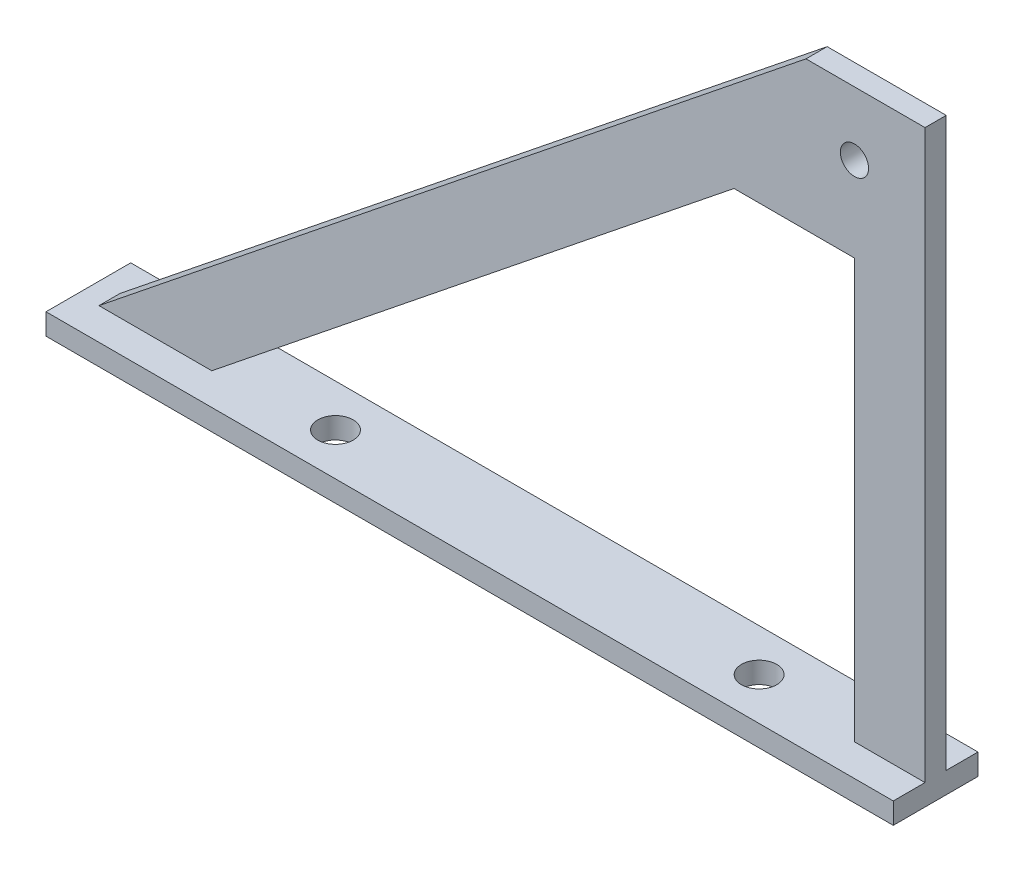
ISO-10303-21;
HEADER;
FILE_DESCRIPTION(('STEP AP214'),'2;1');
FILE_NAME('part.step','',(''),(''),'','','');
FILE_SCHEMA(('AUTOMOTIVE_DESIGN { 1 0 10303 214 1 1 1 1 }'));
ENDSEC;
DATA;
#1=APPLICATION_CONTEXT('core data for automotive mechanical design processes');
#2=APPLICATION_PROTOCOL_DEFINITION('international standard','automotive_design',2000,#1);
#3=PRODUCT_CONTEXT('',#1,'mechanical');
#4=PRODUCT('Part','Part','',(#3));
#5=PRODUCT_RELATED_PRODUCT_CATEGORY('part','',(#4));
#6=PRODUCT_DEFINITION_FORMATION('','',#4);
#7=PRODUCT_DEFINITION_CONTEXT('part definition',#1,'design');
#8=PRODUCT_DEFINITION('design','',#6,#7);
#9=PRODUCT_DEFINITION_SHAPE('','',#8);
#10=(LENGTH_UNIT() NAMED_UNIT(*) SI_UNIT(.MILLI.,.METRE.));
#11=(NAMED_UNIT(*) PLANE_ANGLE_UNIT() SI_UNIT($,.RADIAN.));
#12=(NAMED_UNIT(*) SI_UNIT($,.STERADIAN.) SOLID_ANGLE_UNIT());
#13=UNCERTAINTY_MEASURE_WITH_UNIT(LENGTH_MEASURE(1.E-05),#10,'distance_accuracy_value','');
#14=(GEOMETRIC_REPRESENTATION_CONTEXT(3) GLOBAL_UNCERTAINTY_ASSIGNED_CONTEXT((#13)) GLOBAL_UNIT_ASSIGNED_CONTEXT((#10,
#11,#12)) REPRESENTATION_CONTEXT('',''));
#15=CARTESIAN_POINT('',(0.,0.,0.));
#16=DIRECTION('',(0.,0.,1.));
#17=DIRECTION('',(1.,0.,0.));
#18=AXIS2_PLACEMENT_3D('',#15,#16,#17);
#19=CARTESIAN_POINT('',(60.,3.,50.));
#20=DIRECTION('',(-1.,0.,0.));
#21=DIRECTION('',(0.,0.,1.));
#22=AXIS2_PLACEMENT_3D('',#19,#20,#21);
#23=PLANE('',#22);
#24=DIRECTION('',(0.,1.,0.));
#25=VECTOR('',#24,1.);
#26=CARTESIAN_POINT('',(60.,96.8669270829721,54.5));
#27=LINE('',#26,#25);
#28=CARTESIAN_POINT('',(60.,3.,54.5));
#29=VERTEX_POINT('',#28);
#30=CARTESIAN_POINT('',(60.,83.3390295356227,54.5));
#31=VERTEX_POINT('',#30);
#32=EDGE_CURVE('E182',#29,#31,#27,.T.);
#33=ORIENTED_EDGE('',*,*,#32,.T.);
#34=DIRECTION('',(0.,0.,1.));
#35=VECTOR('',#34,1.);
#36=CARTESIAN_POINT('',(60.,83.3390295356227,-62.5));
#37=LINE('',#36,#35);
#38=CARTESIAN_POINT('',(60.,83.3390295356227,57.5));
#39=VERTEX_POINT('',#38);
#40=EDGE_CURVE('E62',#31,#39,#37,.T.);
#41=ORIENTED_EDGE('',*,*,#40,.T.);
#42=DIRECTION('',(0.,1.,0.));
#43=VECTOR('',#42,1.);
#44=CARTESIAN_POINT('',(60.,96.8669270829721,57.5));
#45=LINE('',#44,#43);
#46=CARTESIAN_POINT('',(60.,3.,57.5));
#47=VERTEX_POINT('',#46);
#48=EDGE_CURVE('E149',#47,#39,#45,.T.);
#49=ORIENTED_EDGE('',*,*,#48,.F.);
#50=DIRECTION('',(0.,0.,-1.));
#51=VECTOR('',#50,1.);
#52=CARTESIAN_POINT('',(60.,3.,50.));
#53=LINE('',#52,#51);
#54=CARTESIAN_POINT('',(60.,3.,62.));
#55=VERTEX_POINT('',#54);
#56=EDGE_CURVE('E197',#55,#47,#53,.T.);
#57=ORIENTED_EDGE('',*,*,#56,.F.);
#58=DIRECTION('',(0.,-1.,0.));
#59=VECTOR('',#58,1.);
#60=CARTESIAN_POINT('',(60.,3.,62.));
#61=LINE('',#60,#59);
#62=CARTESIAN_POINT('',(60.,0.,62.));
#63=VERTEX_POINT('',#62);
#64=EDGE_CURVE('E211',#55,#63,#61,.T.);
#65=ORIENTED_EDGE('',*,*,#64,.T.);
#66=DIRECTION('',(0.,0.,-1.));
#67=VECTOR('',#66,1.);
#68=CARTESIAN_POINT('',(60.,0.,50.));
#69=LINE('',#68,#67);
#70=CARTESIAN_POINT('',(60.,0.,50.));
#71=VERTEX_POINT('',#70);
#72=EDGE_CURVE('E196',#63,#71,#69,.T.);
#73=ORIENTED_EDGE('',*,*,#72,.T.);
#74=DIRECTION('',(0.,-1.,0.));
#75=VECTOR('',#74,1.);
#76=CARTESIAN_POINT('',(60.,3.,50.));
#77=LINE('',#76,#75);
#78=CARTESIAN_POINT('',(60.,3.,50.));
#79=VERTEX_POINT('',#78);
#80=EDGE_CURVE('E55',#79,#71,#77,.T.);
#81=ORIENTED_EDGE('',*,*,#80,.F.);
#82=EDGE_CURVE('E202',#29,#79,#53,.T.);
#83=ORIENTED_EDGE('',*,*,#82,.F.);
#84=EDGE_LOOP('',(#33,#41,#49,#57,#65,#73,#81,#83));
#85=FACE_BOUND('',#84,.T.);
#86=ADVANCED_FACE('F47',(#85),#23,.F.);
#87=CARTESIAN_POINT('',(-60.,3.,50.));
#88=DIRECTION('',(0.,0.,1.));
#89=DIRECTION('',(1.,0.,0.));
#90=AXIS2_PLACEMENT_3D('',#87,#88,#89);
#91=PLANE('',#90);
#92=DIRECTION('',(-1.,0.,0.));
#93=VECTOR('',#92,1.);
#94=CARTESIAN_POINT('',(-60.,0.,50.));
#95=LINE('',#94,#93);
#96=CARTESIAN_POINT('',(-60.,0.,50.));
#97=VERTEX_POINT('',#96);
#98=EDGE_CURVE('E215',#71,#97,#95,.T.);
#99=ORIENTED_EDGE('',*,*,#98,.T.);
#100=DIRECTION('',(0.,-1.,0.));
#101=VECTOR('',#100,1.);
#102=CARTESIAN_POINT('',(-60.,3.,50.));
#103=LINE('',#102,#101);
#104=CARTESIAN_POINT('',(-60.,3.,50.));
#105=VERTEX_POINT('',#104);
#106=EDGE_CURVE('E231',#105,#97,#103,.T.);
#107=ORIENTED_EDGE('',*,*,#106,.F.);
#108=DIRECTION('',(-1.,0.,0.));
#109=VECTOR('',#108,1.);
#110=CARTESIAN_POINT('',(-60.,3.,50.));
#111=LINE('',#110,#109);
#112=EDGE_CURVE('E201',#79,#105,#111,.T.);
#113=ORIENTED_EDGE('',*,*,#112,.F.);
#114=ORIENTED_EDGE('',*,*,#80,.T.);
#115=EDGE_LOOP('',(#99,#107,#113,#114));
#116=FACE_BOUND('',#115,.T.);
#117=ADVANCED_FACE('F309',(#116),#91,.F.);
#118=CARTESIAN_POINT('',(-60.,3.,50.));
#119=DIRECTION('',(1.,0.,0.));
#120=DIRECTION('',(0.,0.,-1.));
#121=AXIS2_PLACEMENT_3D('',#118,#119,#120);
#122=PLANE('',#121);
#123=DIRECTION('',(0.,0.,1.));
#124=VECTOR('',#123,1.);
#125=CARTESIAN_POINT('',(-60.,0.,50.));
#126=LINE('',#125,#124);
#127=CARTESIAN_POINT('',(-60.,0.,62.));
#128=VERTEX_POINT('',#127);
#129=EDGE_CURVE('E218',#97,#128,#126,.T.);
#130=ORIENTED_EDGE('',*,*,#129,.T.);
#131=DIRECTION('',(0.,-1.,0.));
#132=VECTOR('',#131,1.);
#133=CARTESIAN_POINT('',(-60.,3.,62.));
#134=LINE('',#133,#132);
#135=CARTESIAN_POINT('',(-60.,3.,62.));
#136=VERTEX_POINT('',#135);
#137=EDGE_CURVE('E227',#136,#128,#134,.T.);
#138=ORIENTED_EDGE('',*,*,#137,.F.);
#139=DIRECTION('',(0.,0.,1.));
#140=VECTOR('',#139,1.);
#141=CARTESIAN_POINT('',(-60.,3.,50.));
#142=LINE('',#141,#140);
#143=EDGE_CURVE('E205',#105,#136,#142,.T.);
#144=ORIENTED_EDGE('',*,*,#143,.F.);
#145=ORIENTED_EDGE('',*,*,#106,.T.);
#146=EDGE_LOOP('',(#130,#138,#144,#145));
#147=FACE_BOUND('',#146,.T.);
#148=ADVANCED_FACE('F341',(#147),#122,.F.);
#149=CARTESIAN_POINT('',(-60.,3.,62.));
#150=DIRECTION('',(0.,0.,-1.));
#151=DIRECTION('',(-1.,0.,0.));
#152=AXIS2_PLACEMENT_3D('',#149,#150,#151);
#153=PLANE('',#152);
#154=DIRECTION('',(1.,0.,0.));
#155=VECTOR('',#154,1.);
#156=CARTESIAN_POINT('',(-60.,0.,62.));
#157=LINE('',#156,#155);
#158=EDGE_CURVE('E221',#128,#63,#157,.T.);
#159=ORIENTED_EDGE('',*,*,#158,.T.);
#160=ORIENTED_EDGE('',*,*,#64,.F.);
#161=DIRECTION('',(1.,0.,0.));
#162=VECTOR('',#161,1.);
#163=CARTESIAN_POINT('',(-60.,3.,62.));
#164=LINE('',#163,#162);
#165=EDGE_CURVE('E208',#136,#55,#164,.T.);
#166=ORIENTED_EDGE('',*,*,#165,.F.);
#167=ORIENTED_EDGE('',*,*,#137,.T.);
#168=EDGE_LOOP('',(#159,#160,#166,#167));
#169=FACE_BOUND('',#168,.T.);
#170=ADVANCED_FACE('F299',(#169),#153,.F.);
#171=CARTESIAN_POINT('',(0.,3.,0.));
#172=DIRECTION('',(0.,1.,0.));
#173=DIRECTION('',(0.,0.,1.));
#174=AXIS2_PLACEMENT_3D('',#171,#172,#173);
#175=PLANE('',#174);
#176=CARTESIAN_POINT('',(-25.,3.,56.));
#177=DIRECTION('',(0.,1.,0.));
#178=DIRECTION('',(0.,0.,1.));
#179=AXIS2_PLACEMENT_3D('',#176,#177,#178);
#180=CIRCLE('',#179,2.5);
#181=CARTESIAN_POINT('',(-25.,3.,58.5));
#182=VERTEX_POINT('',#181);
#183=EDGE_CURVE('E242',#182,#182,#180,.T.);
#184=ORIENTED_EDGE('',*,*,#183,.F.);
#185=EDGE_LOOP('',(#184));
#186=FACE_BOUND('',#185,.T.);
#187=CARTESIAN_POINT('',(35.,3.,56.));
#188=DIRECTION('',(0.,1.,0.));
#189=DIRECTION('',(0.,0.,1.));
#190=AXIS2_PLACEMENT_3D('',#187,#188,#189);
#191=CIRCLE('',#190,2.5);
#192=CARTESIAN_POINT('',(35.,3.,58.5));
#193=VERTEX_POINT('',#192);
#194=EDGE_CURVE('E272',#193,#193,#191,.T.);
#195=ORIENTED_EDGE('',*,*,#194,.F.);
#196=EDGE_LOOP('',(#195));
#197=FACE_BOUND('',#196,.T.);
#198=DIRECTION('',(1.,0.,0.));
#199=VECTOR('',#198,1.);
#200=CARTESIAN_POINT('',(-41.0199306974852,3.,57.5));
#201=LINE('',#200,#199);
#202=CARTESIAN_POINT('',(-57.,3.,57.5));
#203=VERTEX_POINT('',#202);
#204=CARTESIAN_POINT('',(-41.0199306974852,3.,57.5));
#205=VERTEX_POINT('',#204);
#206=EDGE_CURVE('E188',#203,#205,#201,.T.);
#207=ORIENTED_EDGE('',*,*,#206,.F.);
#208=DIRECTION('',(0.,0.,-1.));
#209=VECTOR('',#208,1.);
#210=CARTESIAN_POINT('',(-57.,3.,57.5));
#211=LINE('',#210,#209);
#212=CARTESIAN_POINT('',(-57.,3.,54.5));
#213=VERTEX_POINT('',#212);
#214=EDGE_CURVE('E154',#203,#213,#211,.T.);
#215=ORIENTED_EDGE('',*,*,#214,.T.);
#216=DIRECTION('',(1.,0.,0.));
#217=VECTOR('',#216,1.);
#218=CARTESIAN_POINT('',(-41.0199306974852,3.,54.5));
#219=LINE('',#218,#217);
#220=CARTESIAN_POINT('',(-41.0199306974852,3.,54.5));
#221=VERTEX_POINT('',#220);
#222=EDGE_CURVE('E166',#213,#221,#219,.T.);
#223=ORIENTED_EDGE('',*,*,#222,.T.);
#224=DIRECTION('',(0.,0.,-1.));
#225=VECTOR('',#224,1.);
#226=CARTESIAN_POINT('',(-41.0199306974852,3.,57.5));
#227=LINE('',#226,#225);
#228=EDGE_CURVE('E193',#205,#221,#227,.T.);
#229=ORIENTED_EDGE('',*,*,#228,.F.);
#230=EDGE_LOOP('',(#207,#215,#223,#229));
#231=FACE_BOUND('',#230,.T.);
#232=DIRECTION('',(1.,0.,0.));
#233=VECTOR('',#232,1.);
#234=CARTESIAN_POINT('',(60.,3.,57.5));
#235=LINE('',#234,#233);
#236=CARTESIAN_POINT('',(50.,3.,57.5));
#237=VERTEX_POINT('',#236);
#238=EDGE_CURVE('E162',#237,#47,#235,.T.);
#239=ORIENTED_EDGE('',*,*,#238,.F.);
#240=DIRECTION('',(0.,0.,-1.));
#241=VECTOR('',#240,1.);
#242=CARTESIAN_POINT('',(50.,3.,57.5));
#243=LINE('',#242,#241);
#244=CARTESIAN_POINT('',(50.,3.,54.5));
#245=VERTEX_POINT('',#244);
#246=EDGE_CURVE('E160',#237,#245,#243,.T.);
#247=ORIENTED_EDGE('',*,*,#246,.T.);
#248=DIRECTION('',(1.,0.,0.));
#249=VECTOR('',#248,1.);
#250=CARTESIAN_POINT('',(60.,3.,54.5));
#251=LINE('',#250,#249);
#252=EDGE_CURVE('E178',#245,#29,#251,.T.);
#253=ORIENTED_EDGE('',*,*,#252,.T.);
#254=ORIENTED_EDGE('',*,*,#82,.T.);
#255=ORIENTED_EDGE('',*,*,#112,.T.);
#256=ORIENTED_EDGE('',*,*,#143,.T.);
#257=ORIENTED_EDGE('',*,*,#165,.T.);
#258=ORIENTED_EDGE('',*,*,#56,.T.);
#259=EDGE_LOOP('',(#239,#247,#253,#254,#255,#256,#257,#258));
#260=FACE_BOUND('',#259,.T.);
#261=ADVANCED_FACE('F293',(#186,#197,#231,#260),#175,.T.);
#262=CARTESIAN_POINT('',(0.,0.,0.));
#263=DIRECTION('',(0.,1.,0.));
#264=DIRECTION('',(0.,0.,1.));
#265=AXIS2_PLACEMENT_3D('',#262,#263,#264);
#266=PLANE('',#265);
#267=CARTESIAN_POINT('',(-25.,0.,56.));
#268=DIRECTION('',(0.,1.,0.));
#269=DIRECTION('',(0.,0.,1.));
#270=AXIS2_PLACEMENT_3D('',#267,#268,#269);
#271=CIRCLE('',#270,2.5);
#272=CARTESIAN_POINT('',(-25.,0.,58.5));
#273=VERTEX_POINT('',#272);
#274=EDGE_CURVE('E171',#273,#273,#271,.T.);
#275=ORIENTED_EDGE('',*,*,#274,.T.);
#276=EDGE_LOOP('',(#275));
#277=FACE_BOUND('',#276,.T.);
#278=CARTESIAN_POINT('',(35.,0.,56.));
#279=DIRECTION('',(0.,1.,0.));
#280=DIRECTION('',(0.,0.,1.));
#281=AXIS2_PLACEMENT_3D('',#278,#279,#280);
#282=CIRCLE('',#281,2.5);
#283=CARTESIAN_POINT('',(35.,0.,58.5));
#284=VERTEX_POINT('',#283);
#285=EDGE_CURVE('E238',#284,#284,#282,.T.);
#286=ORIENTED_EDGE('',*,*,#285,.T.);
#287=EDGE_LOOP('',(#286));
#288=FACE_BOUND('',#287,.T.);
#289=ORIENTED_EDGE('',*,*,#72,.F.);
#290=ORIENTED_EDGE('',*,*,#158,.F.);
#291=ORIENTED_EDGE('',*,*,#129,.F.);
#292=ORIENTED_EDGE('',*,*,#98,.F.);
#293=EDGE_LOOP('',(#289,#290,#291,#292));
#294=FACE_BOUND('',#293,.T.);
#295=ADVANCED_FACE('F304',(#277,#288,#294),#266,.F.);
#296=CARTESIAN_POINT('',(50.,76.0235999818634,57.5));
#297=DIRECTION('',(-0.625779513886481,0.78,0.));
#298=DIRECTION('',(-0.78,-0.625779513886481,0.));
#299=AXIS2_PLACEMENT_3D('',#296,#297,#298);
#300=PLANE('',#299);
#301=DIRECTION('',(0.78,0.625779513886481,0.));
#302=VECTOR('',#301,1.);
#303=CARTESIAN_POINT('',(50.,76.0235999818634,54.5));
#304=LINE('',#303,#302);
#305=CARTESIAN_POINT('',(32.9429300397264,62.3390295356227,54.5));
#306=VERTEX_POINT('',#305);
#307=EDGE_CURVE('E170',#221,#306,#304,.T.);
#308=ORIENTED_EDGE('',*,*,#307,.T.);
#309=DIRECTION('',(0.,0.,1.));
#310=VECTOR('',#309,1.);
#311=CARTESIAN_POINT('',(32.9429300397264,62.3390295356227,54.5));
#312=LINE('',#311,#310);
#313=CARTESIAN_POINT('',(32.9429300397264,62.3390295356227,57.5));
#314=VERTEX_POINT('',#313);
#315=EDGE_CURVE('E263',#306,#314,#312,.T.);
#316=ORIENTED_EDGE('',*,*,#315,.T.);
#317=DIRECTION('',(0.78,0.625779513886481,0.));
#318=VECTOR('',#317,1.);
#319=CARTESIAN_POINT('',(50.,76.0235999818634,57.5));
#320=LINE('',#319,#318);
#321=EDGE_CURVE('E281',#205,#314,#320,.T.);
#322=ORIENTED_EDGE('',*,*,#321,.F.);
#323=ORIENTED_EDGE('',*,*,#228,.T.);
#324=EDGE_LOOP('',(#308,#316,#322,#323));
#325=FACE_BOUND('',#324,.T.);
#326=ADVANCED_FACE('F322',(#325),#300,.F.);
#327=CARTESIAN_POINT('',(50.,3.,57.5));
#328=DIRECTION('',(1.,0.,0.));
#329=DIRECTION('',(0.,0.,-1.));
#330=AXIS2_PLACEMENT_3D('',#327,#328,#329);
#331=PLANE('',#330);
#332=DIRECTION('',(0.,-1.,0.));
#333=VECTOR('',#332,1.);
#334=CARTESIAN_POINT('',(50.,3.,57.5));
#335=LINE('',#334,#333);
#336=CARTESIAN_POINT('',(50.,62.3390295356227,57.5));
#337=VERTEX_POINT('',#336);
#338=EDGE_CURVE('E284',#337,#237,#335,.T.);
#339=ORIENTED_EDGE('',*,*,#338,.F.);
#340=DIRECTION('',(0.,0.,-1.));
#341=VECTOR('',#340,1.);
#342=CARTESIAN_POINT('',(50.,62.3390295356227,57.5));
#343=LINE('',#342,#341);
#344=CARTESIAN_POINT('',(50.,62.3390295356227,54.5));
#345=VERTEX_POINT('',#344);
#346=EDGE_CURVE('E268',#337,#345,#343,.T.);
#347=ORIENTED_EDGE('',*,*,#346,.T.);
#348=DIRECTION('',(0.,-1.,0.));
#349=VECTOR('',#348,1.);
#350=CARTESIAN_POINT('',(50.,3.,54.5));
#351=LINE('',#350,#349);
#352=EDGE_CURVE('E175',#345,#245,#351,.T.);
#353=ORIENTED_EDGE('',*,*,#352,.T.);
#354=ORIENTED_EDGE('',*,*,#246,.F.);
#355=EDGE_LOOP('',(#339,#347,#353,#354));
#356=FACE_BOUND('',#355,.T.);
#357=ADVANCED_FACE('F326',(#356),#331,.F.);
#358=CARTESIAN_POINT('',(-57.,3.,57.5));
#359=DIRECTION('',(0.625779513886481,-0.78,0.));
#360=DIRECTION('',(0.78,0.625779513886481,0.));
#361=AXIS2_PLACEMENT_3D('',#358,#359,#360);
#362=PLANE('',#361);
#363=DIRECTION('',(-0.78,-0.625779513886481,0.));
#364=VECTOR('',#363,1.);
#365=CARTESIAN_POINT('',(-57.,3.,57.5));
#366=LINE('',#365,#364);
#367=CARTESIAN_POINT('',(43.1382142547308,83.3390295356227,57.5));
#368=VERTEX_POINT('',#367);
#369=EDGE_CURVE('E146',#368,#203,#366,.T.);
#370=ORIENTED_EDGE('',*,*,#369,.F.);
#371=DIRECTION('',(0.,0.,1.));
#372=VECTOR('',#371,1.);
#373=CARTESIAN_POINT('',(43.1382142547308,83.3390295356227,-62.5));
#374=LINE('',#373,#372);
#375=CARTESIAN_POINT('',(43.1382142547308,83.3390295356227,54.5));
#376=VERTEX_POINT('',#375);
#377=EDGE_CURVE('E133',#376,#368,#374,.T.);
#378=ORIENTED_EDGE('',*,*,#377,.F.);
#379=DIRECTION('',(-0.78,-0.625779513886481,0.));
#380=VECTOR('',#379,1.);
#381=CARTESIAN_POINT('',(-57.,3.,54.5));
#382=LINE('',#381,#380);
#383=EDGE_CURVE('E186',#376,#213,#382,.T.);
#384=ORIENTED_EDGE('',*,*,#383,.T.);
#385=ORIENTED_EDGE('',*,*,#214,.F.);
#386=EDGE_LOOP('',(#370,#378,#384,#385));
#387=FACE_BOUND('',#386,.T.);
#388=ADVANCED_FACE('F152',(#387),#362,.F.);
#389=CARTESIAN_POINT('',(0.,0.,57.5));
#390=DIRECTION('',(0.,0.,1.));
#391=DIRECTION('',(1.,0.,0.));
#392=AXIS2_PLACEMENT_3D('',#389,#390,#391);
#393=PLANE('',#392);
#394=DIRECTION('',(1.,0.,0.));
#395=VECTOR('',#394,1.);
#396=CARTESIAN_POINT('',(60.,83.3390295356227,57.5));
#397=LINE('',#396,#395);
#398=EDGE_CURVE('E136',#368,#39,#397,.T.);
#399=ORIENTED_EDGE('',*,*,#398,.F.);
#400=ORIENTED_EDGE('',*,*,#369,.T.);
#401=ORIENTED_EDGE('',*,*,#206,.T.);
#402=ORIENTED_EDGE('',*,*,#321,.T.);
#403=DIRECTION('',(1.,0.,0.));
#404=VECTOR('',#403,1.);
#405=CARTESIAN_POINT('',(55.489438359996,62.3390295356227,57.5));
#406=LINE('',#405,#404);
#407=EDGE_CURVE('E69',#314,#337,#406,.T.);
#408=ORIENTED_EDGE('',*,*,#407,.T.);
#409=ORIENTED_EDGE('',*,*,#338,.T.);
#410=ORIENTED_EDGE('',*,*,#238,.T.);
#411=ORIENTED_EDGE('',*,*,#48,.T.);
#412=EDGE_LOOP('',(#399,#400,#401,#402,#408,#409,#410,#411));
#413=FACE_BOUND('',#412,.T.);
#414=CARTESIAN_POINT('',(50.,74.3390295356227,57.5));
#415=DIRECTION('',(0.,0.,1.));
#416=DIRECTION('',(1.,0.,0.));
#417=AXIS2_PLACEMENT_3D('',#414,#415,#416);
#418=CIRCLE('',#417,2.);
#419=CARTESIAN_POINT('',(52.,74.3390295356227,57.5));
#420=VERTEX_POINT('',#419);
#421=EDGE_CURVE('E248',#420,#420,#418,.T.);
#422=ORIENTED_EDGE('',*,*,#421,.F.);
#423=EDGE_LOOP('',(#422));
#424=FACE_BOUND('',#423,.T.);
#425=ADVANCED_FACE('F143',(#413,#424),#393,.T.);
#426=CARTESIAN_POINT('',(0.,0.,54.5));
#427=DIRECTION('',(0.,0.,1.));
#428=DIRECTION('',(1.,0.,0.));
#429=AXIS2_PLACEMENT_3D('',#426,#427,#428);
#430=PLANE('',#429);
#431=CARTESIAN_POINT('',(50.,74.3390295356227,54.5));
#432=DIRECTION('',(0.,0.,1.));
#433=DIRECTION('',(1.,0.,0.));
#434=AXIS2_PLACEMENT_3D('',#431,#432,#433);
#435=CIRCLE('',#434,2.);
#436=CARTESIAN_POINT('',(52.,74.3390295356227,54.5));
#437=VERTEX_POINT('',#436);
#438=EDGE_CURVE('E245',#437,#437,#435,.T.);
#439=ORIENTED_EDGE('',*,*,#438,.T.);
#440=EDGE_LOOP('',(#439));
#441=FACE_BOUND('',#440,.T.);
#442=ORIENTED_EDGE('',*,*,#383,.F.);
#443=DIRECTION('',(1.,0.,0.));
#444=VECTOR('',#443,1.);
#445=CARTESIAN_POINT('',(0.,83.3390295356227,54.5));
#446=LINE('',#445,#444);
#447=EDGE_CURVE('E11',#376,#31,#446,.T.);
#448=ORIENTED_EDGE('',*,*,#447,.T.);
#449=ORIENTED_EDGE('',*,*,#32,.F.);
#450=ORIENTED_EDGE('',*,*,#252,.F.);
#451=ORIENTED_EDGE('',*,*,#352,.F.);
#452=DIRECTION('',(1.,0.,0.));
#453=VECTOR('',#452,1.);
#454=CARTESIAN_POINT('',(32.9429300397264,62.3390295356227,54.5));
#455=LINE('',#454,#453);
#456=EDGE_CURVE('E253',#306,#345,#455,.T.);
#457=ORIENTED_EDGE('',*,*,#456,.F.);
#458=ORIENTED_EDGE('',*,*,#307,.F.);
#459=ORIENTED_EDGE('',*,*,#222,.F.);
#460=EDGE_LOOP('',(#442,#448,#449,#450,#451,#457,#458,#459));
#461=FACE_BOUND('',#460,.T.);
#462=ADVANCED_FACE('F315',(#441,#461),#430,.F.);
#463=CARTESIAN_POINT('',(35.,-4.,56.));
#464=DIRECTION('',(0.,1.,0.));
#465=DIRECTION('',(0.,0.,1.));
#466=AXIS2_PLACEMENT_3D('',#463,#464,#465);
#467=CYLINDRICAL_SURFACE('',#466,2.5);
#468=ORIENTED_EDGE('',*,*,#194,.T.);
#469=EDGE_LOOP('',(#468));
#470=FACE_BOUND('',#469,.T.);
#471=ORIENTED_EDGE('',*,*,#285,.F.);
#472=EDGE_LOOP('',(#471));
#473=FACE_BOUND('',#472,.T.);
#474=ADVANCED_FACE('F361',(#470,#473),#467,.F.);
#475=CARTESIAN_POINT('',(-25.,-4.,56.));
#476=DIRECTION('',(0.,1.,0.));
#477=DIRECTION('',(0.,0.,1.));
#478=AXIS2_PLACEMENT_3D('',#475,#476,#477);
#479=CYLINDRICAL_SURFACE('',#478,2.5);
#480=ORIENTED_EDGE('',*,*,#183,.T.);
#481=EDGE_LOOP('',(#480));
#482=FACE_BOUND('',#481,.T.);
#483=ORIENTED_EDGE('',*,*,#274,.F.);
#484=EDGE_LOOP('',(#483));
#485=FACE_BOUND('',#484,.T.);
#486=ADVANCED_FACE('F364',(#482,#485),#479,.F.);
#487=CARTESIAN_POINT('',(55.489438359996,62.3390295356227,54.5));
#488=DIRECTION('',(0.,-1.,0.));
#489=DIRECTION('',(0.,0.,-1.));
#490=AXIS2_PLACEMENT_3D('',#487,#488,#489);
#491=PLANE('',#490);
#492=ORIENTED_EDGE('',*,*,#346,.F.);
#493=ORIENTED_EDGE('',*,*,#407,.F.);
#494=ORIENTED_EDGE('',*,*,#315,.F.);
#495=ORIENTED_EDGE('',*,*,#456,.T.);
#496=EDGE_LOOP('',(#492,#493,#494,#495));
#497=FACE_BOUND('',#496,.T.);
#498=ADVANCED_FACE('F324',(#497),#491,.T.);
#499=CARTESIAN_POINT('',(50.,74.3390295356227,-62.5));
#500=DIRECTION('',(0.,0.,1.));
#501=DIRECTION('',(1.,0.,0.));
#502=AXIS2_PLACEMENT_3D('',#499,#500,#501);
#503=CYLINDRICAL_SURFACE('',#502,2.);
#504=ORIENTED_EDGE('',*,*,#421,.T.);
#505=EDGE_LOOP('',(#504));
#506=FACE_BOUND('',#505,.T.);
#507=ORIENTED_EDGE('',*,*,#438,.F.);
#508=EDGE_LOOP('',(#507));
#509=FACE_BOUND('',#508,.T.);
#510=ADVANCED_FACE('F395',(#506,#509),#503,.F.);
#511=CARTESIAN_POINT('',(60.,83.3390295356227,-62.5));
#512=DIRECTION('',(0.,-1.,0.));
#513=DIRECTION('',(0.,0.,-1.));
#514=AXIS2_PLACEMENT_3D('',#511,#512,#513);
#515=PLANE('',#514);
#516=ORIENTED_EDGE('',*,*,#377,.T.);
#517=ORIENTED_EDGE('',*,*,#398,.T.);
#518=ORIENTED_EDGE('',*,*,#40,.F.);
#519=ORIENTED_EDGE('',*,*,#447,.F.);
#520=EDGE_LOOP('',(#516,#517,#518,#519));
#521=FACE_BOUND('',#520,.T.);
#522=ADVANCED_FACE('F135',(#521),#515,.F.);
#523=CLOSED_SHELL('',(#86,#117,#148,#170,#261,#295,#326,#357,#388,#425,#462,#474,#486,#498,#510,#522));
#524=MANIFOLD_SOLID_BREP('B2',#523);
#525=ADVANCED_BREP_SHAPE_REPRESENTATION('',(#18,#524),#14);
#526=SHAPE_DEFINITION_REPRESENTATION(#9,#525);
ENDSEC;
END-ISO-10303-21;
